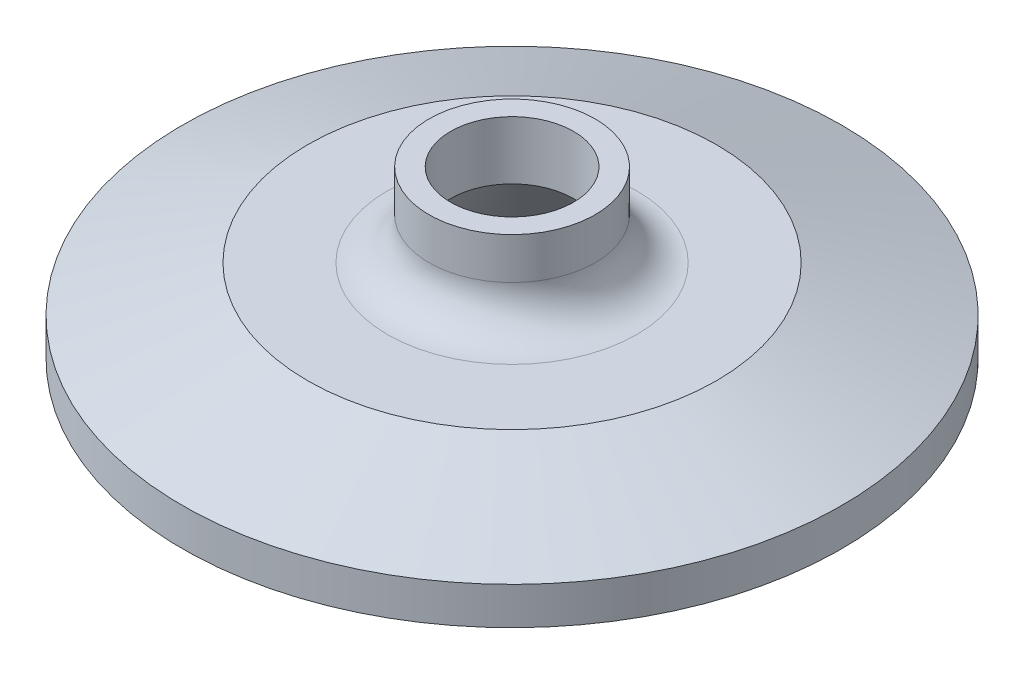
from build123d import *


with BuildPart() as part:
    # Sketch1 → Revolve1 (revolve)
    with BuildSketch(Plane.XY, mode=Mode.PRIVATE) as revolve1_sk:
        with BuildLine():
            Line((-6.35, 12.7), (-6.35, 9.525))
            ThreePointArc((-6.35, 9.525), (-7.27993597, 7.27993597), (-9.525, 6.35))
            Line((-9.525, 6.35), (-15.630196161, 6.35))
            Line((-15.630196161, 6.35), (-25.1968, 2.86804096))
            Line((-25.1968, 2.86804096), (-25.1968, 0))
            Line((-25.1968, 0), (-23.809172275, 0))
            ThreePointArc((-23.809172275, 0), (-23.374577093, 0.130798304), (-23.084366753, 0.479738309))
            Line((-23.084366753, 0.479738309), (-22.917498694, 0.872854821))
            ThreePointArc((-22.917498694, 0.872854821), (-21.8186, 1.6002), (-20.719701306, 0.872854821))
            Line((-20.719701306, 0.872854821), (-20.552833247, 0.479738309))
            ThreePointArc((-20.552833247, 0.479738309), (-20.262622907, 0.130798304), (-19.828027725, 0))
            Line((-19.828027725, 0), (-11.049, 0))
            Line((-11.049, 0), (-4.699, 8.248620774))
            Line((-4.699, 8.248620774), (-4.699, 12.7))
            Line((-4.699, 12.7), (-6.35, 12.7))
        make_face()
    revolve(revolve1_sk.sketch.rotate(Axis((0, 0, 0), (0, 1, 0)), 270), axis=Axis((0, 0, 0), (0, 1, 0)))


solid = part.part
